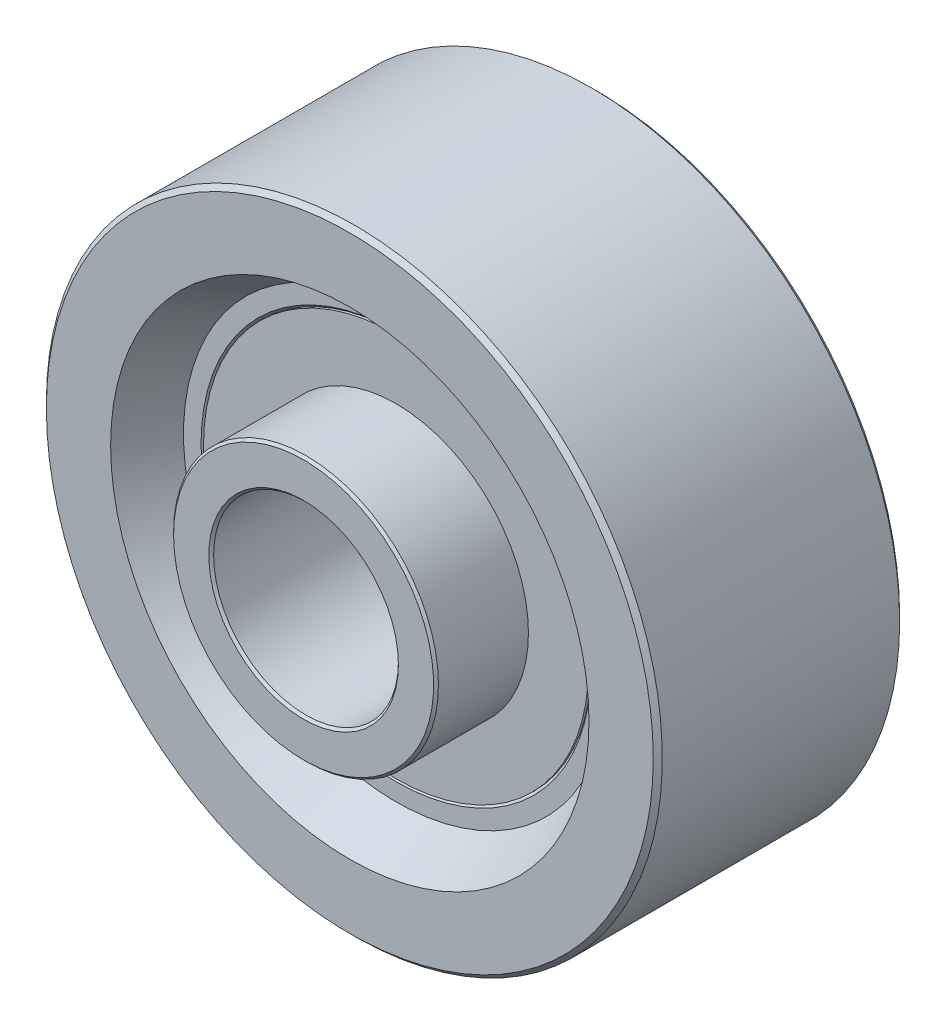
ISO-10303-21;
HEADER;
FILE_DESCRIPTION(('STEP AP214'),'2;1');
FILE_NAME('part.step','',(''),(''),'','','');
FILE_SCHEMA(('AUTOMOTIVE_DESIGN { 1 0 10303 214 1 1 1 1 }'));
ENDSEC;
DATA;
#1=APPLICATION_CONTEXT('core data for automotive mechanical design processes');
#2=APPLICATION_PROTOCOL_DEFINITION('international standard','automotive_design',2000,#1);
#3=PRODUCT_CONTEXT('',#1,'mechanical');
#4=PRODUCT('Part','Part','',(#3));
#5=PRODUCT_RELATED_PRODUCT_CATEGORY('part','',(#4));
#6=PRODUCT_DEFINITION_FORMATION('','',#4);
#7=PRODUCT_DEFINITION_CONTEXT('part definition',#1,'design');
#8=PRODUCT_DEFINITION('design','',#6,#7);
#9=PRODUCT_DEFINITION_SHAPE('','',#8);
#10=(LENGTH_UNIT() NAMED_UNIT(*) SI_UNIT(.MILLI.,.METRE.));
#11=(NAMED_UNIT(*) PLANE_ANGLE_UNIT() SI_UNIT($,.RADIAN.));
#12=(NAMED_UNIT(*) SI_UNIT($,.STERADIAN.) SOLID_ANGLE_UNIT());
#13=UNCERTAINTY_MEASURE_WITH_UNIT(LENGTH_MEASURE(1.E-05),#10,'distance_accuracy_value','');
#14=(GEOMETRIC_REPRESENTATION_CONTEXT(3) GLOBAL_UNCERTAINTY_ASSIGNED_CONTEXT((#13)) GLOBAL_UNIT_ASSIGNED_CONTEXT((#10,
#11,#12)) REPRESENTATION_CONTEXT('',''));
#15=CARTESIAN_POINT('',(0.,0.,0.));
#16=DIRECTION('',(0.,0.,1.));
#17=DIRECTION('',(1.,0.,0.));
#18=AXIS2_PLACEMENT_3D('',#15,#16,#17);
#19=CARTESIAN_POINT('',(0.,0.,2.1875));
#20=DIRECTION('',(0.,0.,-1.));
#21=DIRECTION('',(-1.,0.,0.));
#22=AXIS2_PLACEMENT_3D('',#19,#20,#21);
#23=CYLINDRICAL_SURFACE('',#22,6.25);
#24=CARTESIAN_POINT('',(0.,0.,2.5));
#25=DIRECTION('',(0.,0.,-1.));
#26=DIRECTION('',(-1.,0.,0.));
#27=AXIS2_PLACEMENT_3D('',#24,#25,#26);
#28=CIRCLE('',#27,6.25);
#29=CARTESIAN_POINT('',(-6.25,0.,2.5));
#30=VERTEX_POINT('',#29);
#31=EDGE_CURVE('E25',#30,#30,#28,.T.);
#32=ORIENTED_EDGE('',*,*,#31,.T.);
#33=EDGE_LOOP('',(#32));
#34=FACE_BOUND('',#33,.T.);
#35=CARTESIAN_POINT('',(0.,0.,2.42000000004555));
#36=DIRECTION('',(0.,0.,1.));
#37=DIRECTION('',(0.,1.,0.));
#38=AXIS2_PLACEMENT_3D('',#35,#36,#37);
#39=CIRCLE('',#38,6.24999999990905);
#40=CARTESIAN_POINT('',(0.,6.24999999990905,2.42000000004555));
#41=VERTEX_POINT('',#40);
#42=EDGE_CURVE('E8',#41,#41,#39,.T.);
#43=ORIENTED_EDGE('',*,*,#42,.T.);
#44=EDGE_LOOP('',(#43));
#45=FACE_BOUND('',#44,.T.);
#46=ADVANCED_FACE('F12',(#34,#45),#23,.T.);
#47=CARTESIAN_POINT('',(0.,5.275,2.5));
#48=DIRECTION('',(0.,0.,1.));
#49=DIRECTION('',(1.,0.,0.));
#50=AXIS2_PLACEMENT_3D('',#47,#48,#49);
#51=PLANE('',#50);
#52=ORIENTED_EDGE('',*,*,#31,.F.);
#53=EDGE_LOOP('',(#52));
#54=FACE_BOUND('',#53,.T.);
#55=CARTESIAN_POINT('',(0.,0.,2.5));
#56=DIRECTION('',(0.,0.,-1.));
#57=DIRECTION('',(-1.,0.,0.));
#58=AXIS2_PLACEMENT_3D('',#55,#56,#57);
#59=CIRCLE('',#58,4.3);
#60=CARTESIAN_POINT('',(-4.3,0.,2.5));
#61=VERTEX_POINT('',#60);
#62=EDGE_CURVE('E20',#61,#61,#59,.T.);
#63=ORIENTED_EDGE('',*,*,#62,.T.);
#64=EDGE_LOOP('',(#63));
#65=FACE_BOUND('',#64,.T.);
#66=ADVANCED_FACE('F83',(#54,#65),#51,.T.);
#67=CARTESIAN_POINT('',(0.,0.,-2.5000000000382));
#68=DIRECTION('',(0.,0.,-1.));
#69=DIRECTION('',(-1.,0.,0.));
#70=AXIS2_PLACEMENT_3D('',#67,#68,#69);
#71=CONICAL_SURFACE('',#70,6.32999999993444,0.785398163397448);
#72=CARTESIAN_POINT('',(0.,0.,-2.5000000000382));
#73=DIRECTION('',(0.,0.,-1.));
#74=DIRECTION('',(-1.,0.,0.));
#75=AXIS2_PLACEMENT_3D('',#72,#73,#74);
#76=CIRCLE('',#75,6.32999999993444);
#77=CARTESIAN_POINT('',(-6.32999999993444,0.,-2.5000000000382));
#78=VERTEX_POINT('',#77);
#79=EDGE_CURVE('E49',#78,#78,#76,.F.);
#80=ORIENTED_EDGE('',*,*,#79,.F.);
#81=EDGE_LOOP('',(#80));
#82=FACE_BOUND('',#81,.T.);
#83=CARTESIAN_POINT('',(0.,0.,-2.42000000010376));
#84=DIRECTION('',(0.,0.,-1.));
#85=DIRECTION('',(-1.,0.,0.));
#86=AXIS2_PLACEMENT_3D('',#83,#84,#85);
#87=CIRCLE('',#86,6.25);
#88=CARTESIAN_POINT('',(-6.25,0.,-2.42000000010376));
#89=VERTEX_POINT('',#88);
#90=EDGE_CURVE('E317',#89,#89,#87,.T.);
#91=ORIENTED_EDGE('',*,*,#90,.F.);
#92=EDGE_LOOP('',(#91));
#93=FACE_BOUND('',#92,.T.);
#94=ADVANCED_FACE('F62',(#82,#93),#71,.F.);
#95=CARTESIAN_POINT('',(0.,6.615,-2.5));
#96=DIRECTION('',(0.,0.,-1.));
#97=DIRECTION('',(-1.,0.,0.));
#98=AXIS2_PLACEMENT_3D('',#95,#96,#97);
#99=PLANE('',#98);
#100=ORIENTED_EDGE('',*,*,#79,.T.);
#101=EDGE_LOOP('',(#100));
#102=FACE_BOUND('',#101,.T.);
#103=CARTESIAN_POINT('',(0.,0.,-2.5));
#104=DIRECTION('',(0.,0.,-1.));
#105=DIRECTION('',(-1.,0.,0.));
#106=AXIS2_PLACEMENT_3D('',#103,#104,#105);
#107=CIRCLE('',#106,6.9);
#108=CARTESIAN_POINT('',(-6.9,0.,-2.5));
#109=VERTEX_POINT('',#108);
#110=EDGE_CURVE('E44',#109,#109,#107,.T.);
#111=ORIENTED_EDGE('',*,*,#110,.T.);
#112=EDGE_LOOP('',(#111));
#113=FACE_BOUND('',#112,.T.);
#114=ADVANCED_FACE('F76',(#102,#113),#99,.T.);
#115=CARTESIAN_POINT('',(0.,0.,-4.));
#116=DIRECTION('',(0.,0.,-1.));
#117=DIRECTION('',(-1.,0.,0.));
#118=AXIS2_PLACEMENT_3D('',#115,#116,#117);
#119=CONICAL_SURFACE('',#118,7.76602540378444,0.523598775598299);
#120=CARTESIAN_POINT('',(0.,0.,-4.));
#121=DIRECTION('',(0.,0.,-1.));
#122=DIRECTION('',(-1.,0.,0.));
#123=AXIS2_PLACEMENT_3D('',#120,#121,#122);
#124=CIRCLE('',#123,7.76602540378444);
#125=CARTESIAN_POINT('',(-7.76602540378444,0.,-4.));
#126=VERTEX_POINT('',#125);
#127=EDGE_CURVE('E38',#126,#126,#124,.F.);
#128=ORIENTED_EDGE('',*,*,#127,.F.);
#129=EDGE_LOOP('',(#128));
#130=FACE_BOUND('',#129,.T.);
#131=ORIENTED_EDGE('',*,*,#110,.F.);
#132=EDGE_LOOP('',(#131));
#133=FACE_BOUND('',#132,.T.);
#134=ADVANCED_FACE('F144',(#130,#133),#119,.F.);
#135=CARTESIAN_POINT('',(0.,8.80948329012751,-4.));
#136=DIRECTION('',(0.,0.,-1.));
#137=DIRECTION('',(-1.,0.,0.));
#138=AXIS2_PLACEMENT_3D('',#135,#136,#137);
#139=PLANE('',#138);
#140=ORIENTED_EDGE('',*,*,#127,.T.);
#141=EDGE_LOOP('',(#140));
#142=FACE_BOUND('',#141,.T.);
#143=CARTESIAN_POINT('',(0.,0.,-4.));
#144=DIRECTION('',(0.,0.,1.));
#145=DIRECTION('',(1.,0.,0.));
#146=AXIS2_PLACEMENT_3D('',#143,#144,#145);
#147=CIRCLE('',#146,9.85294117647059);
#148=CARTESIAN_POINT('',(9.85294117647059,0.,-4.));
#149=VERTEX_POINT('',#148);
#150=EDGE_CURVE('E31',#149,#149,#147,.T.);
#151=ORIENTED_EDGE('',*,*,#150,.F.);
#152=EDGE_LOOP('',(#151));
#153=FACE_BOUND('',#152,.T.);
#154=ADVANCED_FACE('F136',(#142,#153),#139,.T.);
#155=CARTESIAN_POINT('',(0.,0.,-3.85294117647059));
#156=DIRECTION('',(0.,0.,1.));
#157=DIRECTION('',(1.,0.,0.));
#158=AXIS2_PLACEMENT_3D('',#155,#156,#157);
#159=CONICAL_SURFACE('',#158,10.,0.785398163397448);
#160=ORIENTED_EDGE('',*,*,#150,.T.);
#161=EDGE_LOOP('',(#160));
#162=FACE_BOUND('',#161,.T.);
#163=CARTESIAN_POINT('',(0.,0.,-3.85294117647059));
#164=DIRECTION('',(0.,0.,-1.));
#165=DIRECTION('',(-1.,0.,0.));
#166=AXIS2_PLACEMENT_3D('',#163,#164,#165);
#167=CIRCLE('',#166,10.);
#168=CARTESIAN_POINT('',(-10.,0.,-3.85294117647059));
#169=VERTEX_POINT('',#168);
#170=EDGE_CURVE('E29',#169,#169,#167,.F.);
#171=ORIENTED_EDGE('',*,*,#170,.F.);
#172=EDGE_LOOP('',(#171));
#173=FACE_BOUND('',#172,.T.);
#174=ADVANCED_FACE('F132',(#162,#173),#159,.T.);
#175=CARTESIAN_POINT('',(0.,0.,0.));
#176=DIRECTION('',(0.,0.,-1.));
#177=DIRECTION('',(-1.,0.,0.));
#178=AXIS2_PLACEMENT_3D('',#175,#176,#177);
#179=CYLINDRICAL_SURFACE('',#178,10.);
#180=CARTESIAN_POINT('',(0.,0.,3.85294117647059));
#181=DIRECTION('',(0.,0.,-1.));
#182=DIRECTION('',(-1.,0.,0.));
#183=AXIS2_PLACEMENT_3D('',#180,#181,#182);
#184=CIRCLE('',#183,10.);
#185=CARTESIAN_POINT('',(-10.,0.,3.85294117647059));
#186=VERTEX_POINT('',#185);
#187=EDGE_CURVE('E34',#186,#186,#184,.T.);
#188=ORIENTED_EDGE('',*,*,#187,.T.);
#189=EDGE_LOOP('',(#188));
#190=FACE_BOUND('',#189,.T.);
#191=ORIENTED_EDGE('',*,*,#170,.T.);
#192=EDGE_LOOP('',(#191));
#193=FACE_BOUND('',#192,.T.);
#194=ADVANCED_FACE('F72',(#190,#193),#179,.T.);
#195=CARTESIAN_POINT('',(0.,0.,3.85294117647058));
#196=DIRECTION('',(0.,0.,-1.));
#197=DIRECTION('',(-1.,0.,0.));
#198=AXIS2_PLACEMENT_3D('',#195,#196,#197);
#199=CONICAL_SURFACE('',#198,10.,0.785398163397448);
#200=CARTESIAN_POINT('',(0.,0.,4.));
#201=DIRECTION('',(0.,0.,-1.));
#202=DIRECTION('',(-1.,0.,0.));
#203=AXIS2_PLACEMENT_3D('',#200,#201,#202);
#204=CIRCLE('',#203,9.85294117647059);
#205=CARTESIAN_POINT('',(-9.85294117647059,0.,4.));
#206=VERTEX_POINT('',#205);
#207=EDGE_CURVE('E35',#206,#206,#204,.T.);
#208=ORIENTED_EDGE('',*,*,#207,.T.);
#209=EDGE_LOOP('',(#208));
#210=FACE_BOUND('',#209,.T.);
#211=ORIENTED_EDGE('',*,*,#187,.F.);
#212=EDGE_LOOP('',(#211));
#213=FACE_BOUND('',#212,.T.);
#214=ADVANCED_FACE('F131',(#210,#213),#199,.T.);
#215=CARTESIAN_POINT('',(0.,8.80948329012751,4.));
#216=DIRECTION('',(0.,0.,1.));
#217=DIRECTION('',(1.,0.,0.));
#218=AXIS2_PLACEMENT_3D('',#215,#216,#217);
#219=PLANE('',#218);
#220=ORIENTED_EDGE('',*,*,#207,.F.);
#221=EDGE_LOOP('',(#220));
#222=FACE_BOUND('',#221,.T.);
#223=CARTESIAN_POINT('',(0.,0.,4.));
#224=DIRECTION('',(0.,0.,1.));
#225=DIRECTION('',(1.,0.,0.));
#226=AXIS2_PLACEMENT_3D('',#223,#224,#225);
#227=CIRCLE('',#226,7.76602540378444);
#228=CARTESIAN_POINT('',(7.76602540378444,0.,4.));
#229=VERTEX_POINT('',#228);
#230=EDGE_CURVE('E41',#229,#229,#227,.F.);
#231=ORIENTED_EDGE('',*,*,#230,.T.);
#232=EDGE_LOOP('',(#231));
#233=FACE_BOUND('',#232,.T.);
#234=ADVANCED_FACE('F140',(#222,#233),#219,.T.);
#235=CARTESIAN_POINT('',(0.,0.,4.));
#236=DIRECTION('',(0.,0.,1.));
#237=DIRECTION('',(1.,0.,0.));
#238=AXIS2_PLACEMENT_3D('',#235,#236,#237);
#239=CONICAL_SURFACE('',#238,7.76602540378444,0.523598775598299);
#240=CARTESIAN_POINT('',(0.,0.,2.5));
#241=DIRECTION('',(0.,0.,1.));
#242=DIRECTION('',(1.,0.,0.));
#243=AXIS2_PLACEMENT_3D('',#240,#241,#242);
#244=CIRCLE('',#243,6.9);
#245=CARTESIAN_POINT('',(6.9,0.,2.5));
#246=VERTEX_POINT('',#245);
#247=EDGE_CURVE('E47',#246,#246,#244,.T.);
#248=ORIENTED_EDGE('',*,*,#247,.F.);
#249=EDGE_LOOP('',(#248));
#250=FACE_BOUND('',#249,.T.);
#251=ORIENTED_EDGE('',*,*,#230,.F.);
#252=EDGE_LOOP('',(#251));
#253=FACE_BOUND('',#252,.T.);
#254=ADVANCED_FACE('F73',(#250,#253),#239,.F.);
#255=CARTESIAN_POINT('',(0.,6.615,2.5));
#256=DIRECTION('',(0.,0.,1.));
#257=DIRECTION('',(1.,0.,0.));
#258=AXIS2_PLACEMENT_3D('',#255,#256,#257);
#259=PLANE('',#258);
#260=ORIENTED_EDGE('',*,*,#247,.T.);
#261=EDGE_LOOP('',(#260));
#262=FACE_BOUND('',#261,.T.);
#263=CARTESIAN_POINT('',(0.,0.,2.5000000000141));
#264=DIRECTION('',(0.,0.,1.));
#265=DIRECTION('',(1.,0.,0.));
#266=AXIS2_PLACEMENT_3D('',#263,#264,#265);
#267=CIRCLE('',#266,6.32999999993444);
#268=CARTESIAN_POINT('',(6.32999999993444,0.,2.5000000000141));
#269=VERTEX_POINT('',#268);
#270=EDGE_CURVE('E16',#269,#269,#267,.F.);
#271=ORIENTED_EDGE('',*,*,#270,.T.);
#272=EDGE_LOOP('',(#271));
#273=FACE_BOUND('',#272,.T.);
#274=ADVANCED_FACE('F56',(#262,#273),#259,.T.);
#275=CARTESIAN_POINT('',(0.,0.,2.49999999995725));
#276=DIRECTION('',(0.,0.,1.));
#277=DIRECTION('',(1.,0.,0.));
#278=AXIS2_PLACEMENT_3D('',#275,#276,#277);
#279=CONICAL_SURFACE('',#278,6.3299999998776,0.785398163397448);
#280=ORIENTED_EDGE('',*,*,#42,.F.);
#281=EDGE_LOOP('',(#280));
#282=FACE_BOUND('',#281,.T.);
#283=ORIENTED_EDGE('',*,*,#270,.F.);
#284=EDGE_LOOP('',(#283));
#285=FACE_BOUND('',#284,.T.);
#286=ADVANCED_FACE('F14',(#282,#285),#279,.F.);
#287=CARTESIAN_POINT('',(0.,0.,-2.1875));
#288=DIRECTION('',(0.,0.,-1.));
#289=DIRECTION('',(-1.,0.,0.));
#290=AXIS2_PLACEMENT_3D('',#287,#288,#289);
#291=CYLINDRICAL_SURFACE('',#290,6.25);
#292=ORIENTED_EDGE('',*,*,#90,.T.);
#293=EDGE_LOOP('',(#292));
#294=FACE_BOUND('',#293,.T.);
#295=CARTESIAN_POINT('',(0.,0.,-2.5));
#296=DIRECTION('',(0.,0.,-1.));
#297=DIRECTION('',(-1.,0.,0.));
#298=AXIS2_PLACEMENT_3D('',#295,#296,#297);
#299=CIRCLE('',#298,6.25);
#300=CARTESIAN_POINT('',(-6.25,0.,-2.5));
#301=VERTEX_POINT('',#300);
#302=EDGE_CURVE('E315',#301,#301,#299,.T.);
#303=ORIENTED_EDGE('',*,*,#302,.F.);
#304=EDGE_LOOP('',(#303));
#305=FACE_BOUND('',#304,.T.);
#306=ADVANCED_FACE('F59',(#294,#305),#291,.T.);
#307=CARTESIAN_POINT('',(0.,5.275,-2.5));
#308=DIRECTION('',(0.,0.,-1.));
#309=DIRECTION('',(-1.,0.,0.));
#310=AXIS2_PLACEMENT_3D('',#307,#308,#309);
#311=PLANE('',#310);
#312=CARTESIAN_POINT('',(0.,0.,-2.5));
#313=DIRECTION('',(0.,0.,-1.));
#314=DIRECTION('',(-1.,0.,0.));
#315=AXIS2_PLACEMENT_3D('',#312,#313,#314);
#316=CIRCLE('',#315,4.3);
#317=CARTESIAN_POINT('',(-4.3,0.,-2.5));
#318=VERTEX_POINT('',#317);
#319=EDGE_CURVE('E325',#318,#318,#316,.F.);
#320=ORIENTED_EDGE('',*,*,#319,.T.);
#321=EDGE_LOOP('',(#320));
#322=FACE_BOUND('',#321,.T.);
#323=ORIENTED_EDGE('',*,*,#302,.T.);
#324=EDGE_LOOP('',(#323));
#325=FACE_BOUND('',#324,.T.);
#326=ADVANCED_FACE('F69',(#322,#325),#311,.T.);
#327=CARTESIAN_POINT('',(0.,0.,-2.94701611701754));
#328=DIRECTION('',(0.,0.,-1.));
#329=DIRECTION('',(-1.,0.,0.));
#330=AXIS2_PLACEMENT_3D('',#327,#328,#329);
#331=CYLINDRICAL_SURFACE('',#330,4.3);
#332=ORIENTED_EDGE('',*,*,#319,.F.);
#333=EDGE_LOOP('',(#332));
#334=FACE_BOUND('',#333,.T.);
#335=CARTESIAN_POINT('',(0.,0.,-5.4218181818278));
#336=DIRECTION('',(0.,0.,1.));
#337=DIRECTION('',(0.,1.,0.));
#338=AXIS2_PLACEMENT_3D('',#335,#336,#337);
#339=CIRCLE('',#338,4.30000000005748);
#340=CARTESIAN_POINT('',(0.,4.30000000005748,-5.4218181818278));
#341=VERTEX_POINT('',#340);
#342=EDGE_CURVE('E333',#341,#341,#339,.F.);
#343=ORIENTED_EDGE('',*,*,#342,.F.);
#344=EDGE_LOOP('',(#343));
#345=FACE_BOUND('',#344,.T.);
#346=ADVANCED_FACE('F115',(#334,#345),#331,.T.);
#347=CARTESIAN_POINT('',(0.,0.,-5.4218181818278));
#348=DIRECTION('',(0.,0.,1.));
#349=DIRECTION('',(1.,0.,0.));
#350=AXIS2_PLACEMENT_3D('',#347,#348,#349);
#351=CONICAL_SURFACE('',#350,4.30000000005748,0.785398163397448);
#352=ORIENTED_EDGE('',*,*,#342,.T.);
#353=EDGE_LOOP('',(#352));
#354=FACE_BOUND('',#353,.T.);
#355=CARTESIAN_POINT('',(0.,0.,-5.5000000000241));
#356=DIRECTION('',(0.,0.,1.));
#357=DIRECTION('',(1.,0.,0.));
#358=AXIS2_PLACEMENT_3D('',#355,#356,#357);
#359=CIRCLE('',#358,4.22181818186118);
#360=CARTESIAN_POINT('',(4.22181818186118,0.,-5.5000000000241));
#361=VERTEX_POINT('',#360);
#362=EDGE_CURVE('E332',#361,#361,#359,.F.);
#363=ORIENTED_EDGE('',*,*,#362,.F.);
#364=EDGE_LOOP('',(#363));
#365=FACE_BOUND('',#364,.T.);
#366=ADVANCED_FACE('F110',(#354,#365),#351,.T.);
#367=CARTESIAN_POINT('',(0.,3.65,-5.5));
#368=DIRECTION('',(0.,0.,-1.));
#369=DIRECTION('',(-1.,0.,0.));
#370=AXIS2_PLACEMENT_3D('',#367,#368,#369);
#371=PLANE('',#370);
#372=CARTESIAN_POINT('',(0.,0.,-5.49999999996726));
#373=DIRECTION('',(0.,0.,-1.));
#374=DIRECTION('',(-1.,0.,0.));
#375=AXIS2_PLACEMENT_3D('',#372,#373,#374);
#376=CIRCLE('',#375,3.0781818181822);
#377=CARTESIAN_POINT('',(-3.0781818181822,0.,-5.49999999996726));
#378=VERTEX_POINT('',#377);
#379=EDGE_CURVE('E339',#378,#378,#376,.F.);
#380=ORIENTED_EDGE('',*,*,#379,.T.);
#381=EDGE_LOOP('',(#380));
#382=FACE_BOUND('',#381,.T.);
#383=ORIENTED_EDGE('',*,*,#362,.T.);
#384=EDGE_LOOP('',(#383));
#385=FACE_BOUND('',#384,.T.);
#386=ADVANCED_FACE('F104',(#382,#385),#371,.T.);
#387=CARTESIAN_POINT('',(0.,0.,-5.49999999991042));
#388=DIRECTION('',(0.,0.,-1.));
#389=DIRECTION('',(-1.,0.,0.));
#390=AXIS2_PLACEMENT_3D('',#387,#388,#389);
#391=CONICAL_SURFACE('',#390,3.07818181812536,0.785398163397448);
#392=ORIENTED_EDGE('',*,*,#379,.F.);
#393=EDGE_LOOP('',(#392));
#394=FACE_BOUND('',#393,.T.);
#395=CARTESIAN_POINT('',(0.,0.,-5.4218181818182));
#396=DIRECTION('',(0.,0.,-1.));
#397=DIRECTION('',(-1.,0.,0.));
#398=AXIS2_PLACEMENT_3D('',#395,#396,#397);
#399=CIRCLE('',#398,3.);
#400=CARTESIAN_POINT('',(-3.,0.,-5.4218181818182));
#401=VERTEX_POINT('',#400);
#402=EDGE_CURVE('E328',#401,#401,#399,.F.);
#403=ORIENTED_EDGE('',*,*,#402,.T.);
#404=EDGE_LOOP('',(#403));
#405=FACE_BOUND('',#404,.T.);
#406=ADVANCED_FACE('F100',(#394,#405),#391,.F.);
#407=CARTESIAN_POINT('',(0.,0.,0.));
#408=DIRECTION('',(0.,0.,-1.));
#409=DIRECTION('',(-1.,0.,0.));
#410=AXIS2_PLACEMENT_3D('',#407,#408,#409);
#411=CYLINDRICAL_SURFACE('',#410,3.);
#412=ORIENTED_EDGE('',*,*,#402,.F.);
#413=EDGE_LOOP('',(#412));
#414=FACE_BOUND('',#413,.T.);
#415=CARTESIAN_POINT('',(0.,0.,5.42181818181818));
#416=DIRECTION('',(0.,0.,-1.));
#417=DIRECTION('',(-1.,0.,0.));
#418=AXIS2_PLACEMENT_3D('',#415,#416,#417);
#419=CIRCLE('',#418,3.);
#420=CARTESIAN_POINT('',(-3.,0.,5.42181818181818));
#421=VERTEX_POINT('',#420);
#422=EDGE_CURVE('E342',#421,#421,#419,.T.);
#423=ORIENTED_EDGE('',*,*,#422,.F.);
#424=EDGE_LOOP('',(#423));
#425=FACE_BOUND('',#424,.T.);
#426=ADVANCED_FACE('F97',(#414,#425),#411,.F.);
#427=CARTESIAN_POINT('',(0.,0.,5.49999999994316));
#428=DIRECTION('',(0.,0.,1.));
#429=DIRECTION('',(1.,0.,0.));
#430=AXIS2_PLACEMENT_3D('',#427,#428,#429);
#431=CONICAL_SURFACE('',#430,3.07818181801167,0.785398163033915);
#432=ORIENTED_EDGE('',*,*,#422,.T.);
#433=EDGE_LOOP('',(#432));
#434=FACE_BOUND('',#433,.T.);
#435=CARTESIAN_POINT('',(0.,0.,5.5));
#436=DIRECTION('',(0.,0.,1.));
#437=DIRECTION('',(1.,0.,0.));
#438=AXIS2_PLACEMENT_3D('',#435,#436,#437);
#439=CIRCLE('',#438,3.07818181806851);
#440=CARTESIAN_POINT('',(3.07818181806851,0.,5.5));
#441=VERTEX_POINT('',#440);
#442=EDGE_CURVE('E336',#441,#441,#439,.F.);
#443=ORIENTED_EDGE('',*,*,#442,.F.);
#444=EDGE_LOOP('',(#443));
#445=FACE_BOUND('',#444,.T.);
#446=ADVANCED_FACE('F79',(#434,#445),#431,.F.);
#447=CARTESIAN_POINT('',(0.,3.65,5.5));
#448=DIRECTION('',(0.,0.,1.));
#449=DIRECTION('',(1.,0.,0.));
#450=AXIS2_PLACEMENT_3D('',#447,#448,#449);
#451=PLANE('',#450);
#452=CARTESIAN_POINT('',(0.,0.,5.5));
#453=DIRECTION('',(0.,0.,-1.));
#454=DIRECTION('',(-1.,0.,0.));
#455=AXIS2_PLACEMENT_3D('',#452,#453,#454);
#456=CIRCLE('',#455,4.22181818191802);
#457=CARTESIAN_POINT('',(-4.22181818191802,0.,5.5));
#458=VERTEX_POINT('',#457);
#459=EDGE_CURVE('E329',#458,#458,#456,.F.);
#460=ORIENTED_EDGE('',*,*,#459,.T.);
#461=EDGE_LOOP('',(#460));
#462=FACE_BOUND('',#461,.T.);
#463=ORIENTED_EDGE('',*,*,#442,.T.);
#464=EDGE_LOOP('',(#463));
#465=FACE_BOUND('',#464,.T.);
#466=ADVANCED_FACE('F61',(#462,#465),#451,.T.);
#467=CARTESIAN_POINT('',(0.,0.,5.42181818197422));
#468=DIRECTION('',(0.,0.,-1.));
#469=DIRECTION('',(-1.,0.,0.));
#470=AXIS2_PLACEMENT_3D('',#467,#468,#469);
#471=CONICAL_SURFACE('',#470,4.2999999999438,0.785398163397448);
#472=ORIENTED_EDGE('',*,*,#459,.F.);
#473=EDGE_LOOP('',(#472));
#474=FACE_BOUND('',#473,.T.);
#475=CARTESIAN_POINT('',(0.,0.,5.4218181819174));
#476=DIRECTION('',(0.,0.,-1.));
#477=DIRECTION('',(0.,1.,0.));
#478=AXIS2_PLACEMENT_3D('',#475,#476,#477);
#479=CIRCLE('',#478,4.30000000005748);
#480=CARTESIAN_POINT('',(0.,4.30000000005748,5.4218181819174));
#481=VERTEX_POINT('',#480);
#482=EDGE_CURVE('E323',#481,#481,#479,.F.);
#483=ORIENTED_EDGE('',*,*,#482,.T.);
#484=EDGE_LOOP('',(#483));
#485=FACE_BOUND('',#484,.T.);
#486=ADVANCED_FACE('F78',(#474,#485),#471,.T.);
#487=CARTESIAN_POINT('',(0.,0.,2.94701611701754));
#488=DIRECTION('',(0.,0.,-1.));
#489=DIRECTION('',(-1.,0.,0.));
#490=AXIS2_PLACEMENT_3D('',#487,#488,#489);
#491=CYLINDRICAL_SURFACE('',#490,4.3);
#492=ORIENTED_EDGE('',*,*,#482,.F.);
#493=EDGE_LOOP('',(#492));
#494=FACE_BOUND('',#493,.T.);
#495=ORIENTED_EDGE('',*,*,#62,.F.);
#496=EDGE_LOOP('',(#495));
#497=FACE_BOUND('',#496,.T.);
#498=ADVANCED_FACE('F94',(#494,#497),#491,.T.);
#499=CLOSED_SHELL('',(#46,#66,#94,#114,#134,#154,#174,#194,#214,#234,#254,#274,#286,#306,#326,
#346,#366,#386,#406,#426,#446,#466,#486,#498));
#500=MANIFOLD_SOLID_BREP('B1',#499);
#501=ADVANCED_BREP_SHAPE_REPRESENTATION('',(#18,#500),#14);
#502=SHAPE_DEFINITION_REPRESENTATION(#9,#501);
ENDSEC;
END-ISO-10303-21;
